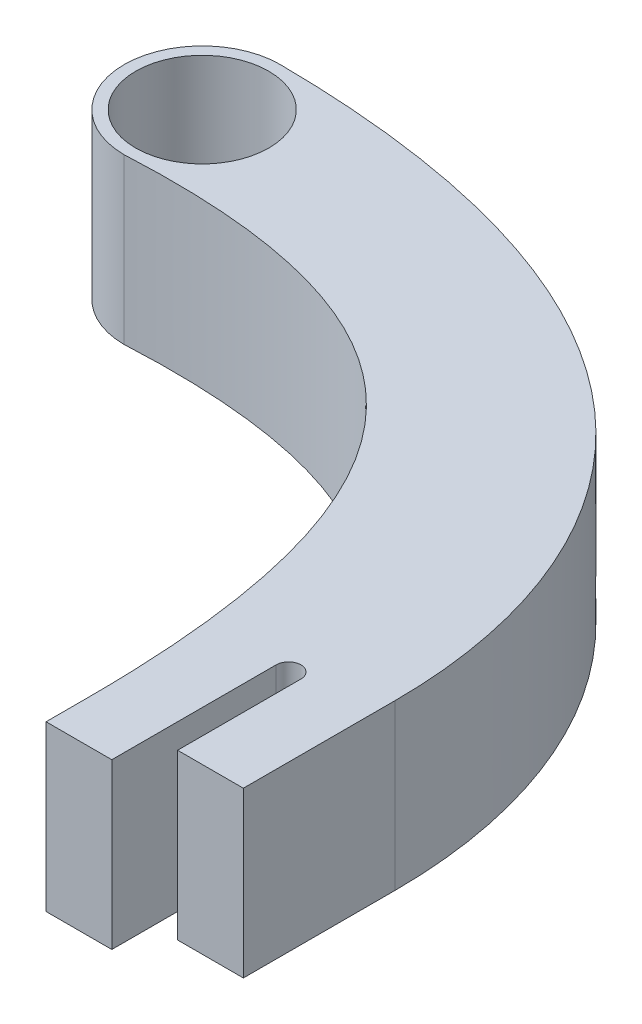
from build123d import *

# Parameters (mm, degrees)
SKETCH_1_R      = 8.1
EXTRUDE_1_DEPTH = 20
SKETCH_3_R      = 8.1
EXTRUDE_2_DEPTH = 2


with BuildPart() as part:
    # Sketch 1 → Extrude 1 (new body)
    with BuildSketch(Plane(origin=(0, 0, 0), x_dir=(1, 0, 0), z_dir=(0, 1, 0))):
        with BuildLine():
            Line((55, -69), (55, -74))
            Line((55, -74), (63, -74))
            Line((63, -74), (63, -54))
            ThreePointArc((63, -54), (64.501858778, -52.498141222), (66.003717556, -54))
            Line((66.003717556, -54), (66.003717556, -68.999300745))
            Line((66.003717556, -68.999300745), (74.003717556, -68.999300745))
            Line((74.003717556, -68.999300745), (74.003717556, -50.540204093))
            add(Edge.make_bspline(
                [(74.003717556, -50.540204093), (74.003717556, -23.617533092), (57.27947195, 9.076427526), (0, 9.5)],
                knots=[0, 0, 0, 0, 1, 1, 1, 1], degree=3))
            ThreePointArc((0, 9.5), (-9.5, 0), (0, -9.5))
            add(Edge.make_bspline(
                [(0, -9.5), (39.009847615, -7.488131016), (55, -25.52744893), (55, -69)],
                knots=[0, 0, 0, 0, 1, 1, 1, 1], degree=3))
        make_face()
        with Locations(Location((0, 0, 0), (0, 0, 270))):
            Circle(SKETCH_1_R, mode=Mode.SUBTRACT)
    extrude(amount=EXTRUDE_1_DEPTH)

    # Sketch 3 → Extrude 2 (add)
    with BuildSketch(Plane.XZ):
        with Locations(Location((0, 0, 0), (0, 0, 270))):
            Circle(SKETCH_3_R)
    extrude(amount=-EXTRUDE_2_DEPTH)


solid = part.part
